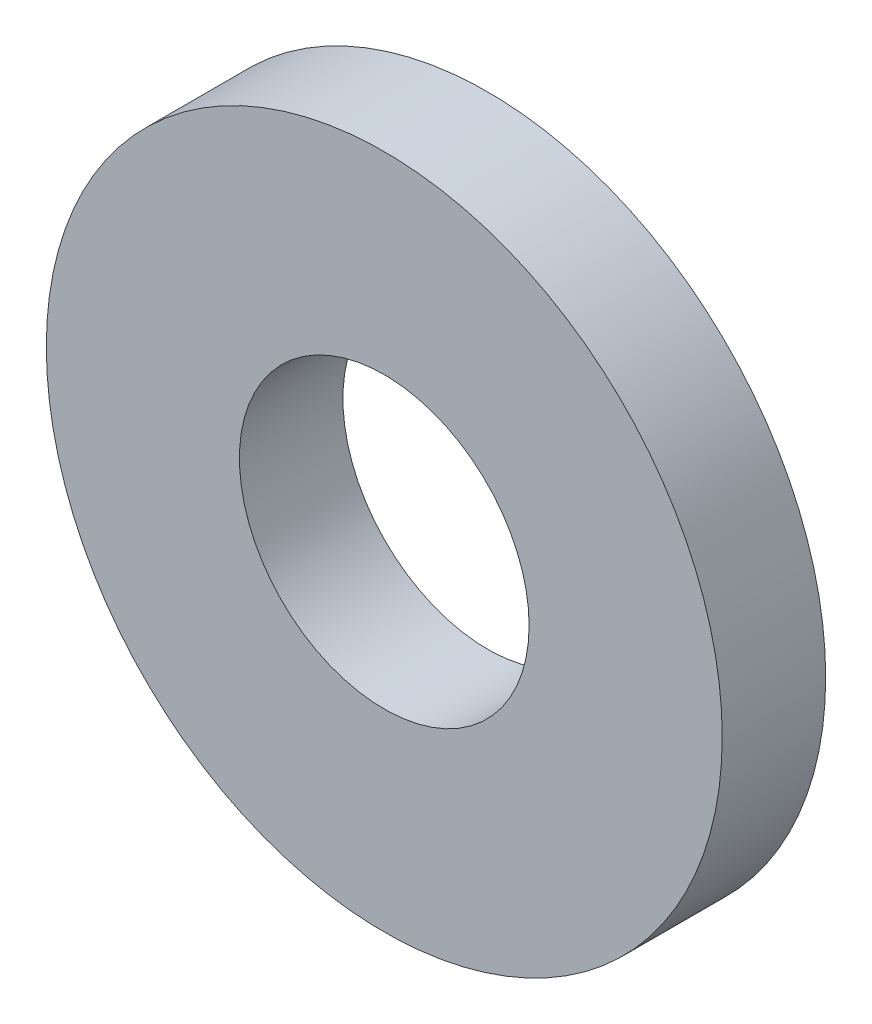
from build123d import *

# Parameters (mm, degrees)
SKETCH1_R        = 12.25
SKETCH1_R_2      = 5.25
EXTRUSION1_DEPTH = 3.75


with BuildPart() as part:
    # Sketch1 → Extrusion1 (new body)
    with BuildSketch(Plane.XY):
        Circle(SKETCH1_R)
        Circle(SKETCH1_R_2, mode=Mode.SUBTRACT)
    extrude(amount=EXTRUSION1_DEPTH)


solid = part.part
